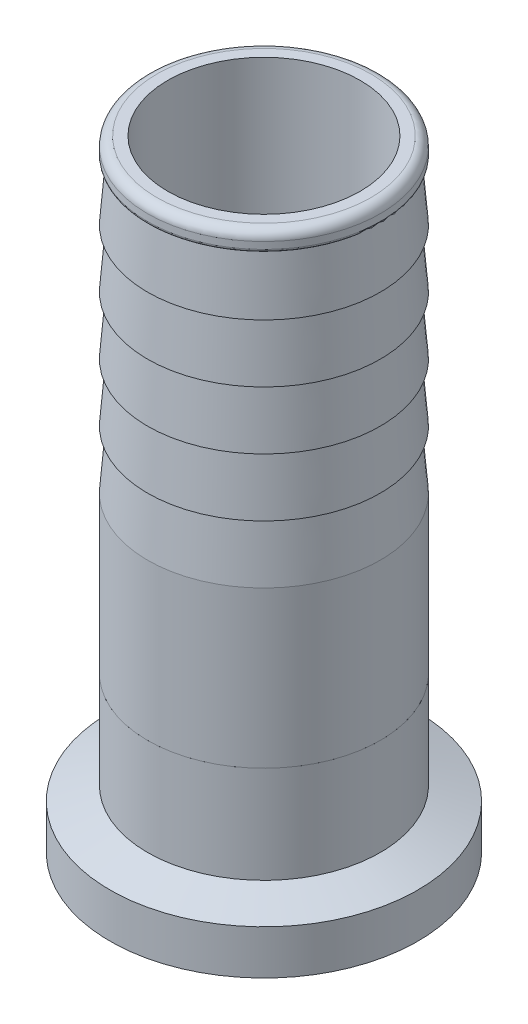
ISO-10303-21;
HEADER;
FILE_DESCRIPTION(('STEP AP214'),'2;1');
FILE_NAME('part.step','',(''),(''),'','','');
FILE_SCHEMA(('AUTOMOTIVE_DESIGN { 1 0 10303 214 1 1 1 1 }'));
ENDSEC;
DATA;
#1=APPLICATION_CONTEXT('core data for automotive mechanical design processes');
#2=APPLICATION_PROTOCOL_DEFINITION('international standard','automotive_design',2000,#1);
#3=PRODUCT_CONTEXT('',#1,'mechanical');
#4=PRODUCT('Part','Part','',(#3));
#5=PRODUCT_RELATED_PRODUCT_CATEGORY('part','',(#4));
#6=PRODUCT_DEFINITION_FORMATION('','',#4);
#7=PRODUCT_DEFINITION_CONTEXT('part definition',#1,'design');
#8=PRODUCT_DEFINITION('design','',#6,#7);
#9=PRODUCT_DEFINITION_SHAPE('','',#8);
#10=(LENGTH_UNIT() NAMED_UNIT(*) SI_UNIT(.MILLI.,.METRE.));
#11=(NAMED_UNIT(*) PLANE_ANGLE_UNIT() SI_UNIT($,.RADIAN.));
#12=(NAMED_UNIT(*) SI_UNIT($,.STERADIAN.) SOLID_ANGLE_UNIT());
#13=UNCERTAINTY_MEASURE_WITH_UNIT(LENGTH_MEASURE(1.E-05),#10,'distance_accuracy_value','');
#14=(GEOMETRIC_REPRESENTATION_CONTEXT(3) GLOBAL_UNCERTAINTY_ASSIGNED_CONTEXT((#13)) GLOBAL_UNIT_ASSIGNED_CONTEXT((#10,
#11,#12)) REPRESENTATION_CONTEXT('',''));
#15=CARTESIAN_POINT('',(0.,0.,0.));
#16=DIRECTION('',(0.,0.,1.));
#17=DIRECTION('',(1.,0.,0.));
#18=AXIS2_PLACEMENT_3D('',#15,#16,#17);
#19=CARTESIAN_POINT('',(21.4887181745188,19.9888650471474,23.0312651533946));
#20=DIRECTION('',(0.,-1.,0.));
#21=DIRECTION('',(0.114692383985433,0.,-0.993401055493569));
#22=AXIS2_PLACEMENT_3D('',#19,#20,#21);
#23=PLANE('',#22);
#24=CARTESIAN_POINT('',(12.026573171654,19.9888650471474,21.9388202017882));
#25=DIRECTION('',(0.,-1.,0.));
#26=DIRECTION('',(0.114692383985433,0.,-0.993401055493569));
#27=AXIS2_PLACEMENT_3D('',#24,#25,#26);
#28=CIRCLE('',#27,7.874);
#29=CARTESIAN_POINT('',(12.9296610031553,19.9888650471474,14.1167802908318));
#30=VERTEX_POINT('',#29);
#31=EDGE_CURVE('P0_E67',#30,#30,#28,.T.);
#32=ORIENTED_EDGE('',*,*,#31,.F.);
#33=EDGE_LOOP('',(#32));
#34=FACE_BOUND('',#33,.T.);
#35=CARTESIAN_POINT('',(12.026573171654,19.9888650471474,21.9388202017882));
#36=DIRECTION('',(0.,-1.,0.));
#37=DIRECTION('',(0.114692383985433,0.,-0.993401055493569));
#38=AXIS2_PLACEMENT_3D('',#35,#36,#37);
#39=CIRCLE('',#38,9.52499994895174);
#40=CARTESIAN_POINT('',(13.1190181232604,19.9888650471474,12.4766751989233));
#41=VERTEX_POINT('',#40);
#42=EDGE_CURVE('P0_E9',#41,#41,#39,.T.);
#43=ORIENTED_EDGE('',*,*,#42,.T.);
#44=EDGE_LOOP('',(#43));
#45=FACE_BOUND('',#44,.T.);
#46=ADVANCED_FACE('P0_F14',(#34,#45),#23,.T.);
#47=CARTESIAN_POINT('',(12.026573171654,19.9888650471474,21.9388202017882));
#48=DIRECTION('',(0.,-1.,0.));
#49=DIRECTION('',(0.114692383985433,0.,-0.993401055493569));
#50=AXIS2_PLACEMENT_3D('',#47,#48,#49);
#51=CYLINDRICAL_SURFACE('',#50,9.52499994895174);
#52=CARTESIAN_POINT('',(12.026573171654,32.7650650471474,21.9388202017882));
#53=DIRECTION('',(0.,-1.,0.));
#54=DIRECTION('',(0.114692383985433,0.,-0.993401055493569));
#55=AXIS2_PLACEMENT_3D('',#52,#53,#54);
#56=CIRCLE('',#55,9.52499994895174);
#57=CARTESIAN_POINT('',(13.1190181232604,32.7650650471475,12.4766751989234));
#58=VERTEX_POINT('',#57);
#59=EDGE_CURVE('P0_E20',#58,#58,#56,.T.);
#60=ORIENTED_EDGE('',*,*,#59,.T.);
#61=EDGE_LOOP('',(#60));
#62=FACE_BOUND('',#61,.T.);
#63=ORIENTED_EDGE('',*,*,#42,.F.);
#64=EDGE_LOOP('',(#63));
#65=FACE_BOUND('',#64,.T.);
#66=ADVANCED_FACE('P0_F83',(#62,#65),#51,.T.);
#67=CARTESIAN_POINT('',(12.026573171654,32.7650650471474,21.9388202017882));
#68=DIRECTION('',(0.,-1.,0.));
#69=DIRECTION('',(0.114692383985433,0.,-0.993401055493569));
#70=AXIS2_PLACEMENT_3D('',#67,#68,#69);
#71=CONICAL_SURFACE('',#70,9.52499994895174,0.0800425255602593);
#72=CARTESIAN_POINT('',(12.026573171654,37.5148650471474,21.9388202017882));
#73=DIRECTION('',(0.,-1.,0.));
#74=DIRECTION('',(0.114692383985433,0.,-0.993401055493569));
#75=AXIS2_PLACEMENT_3D('',#72,#73,#74);
#76=CIRCLE('',#75,9.14399994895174);
#77=CARTESIAN_POINT('',(13.0753203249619,37.5148650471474,12.8551610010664));
#78=VERTEX_POINT('',#77);
#79=EDGE_CURVE('P0_E24',#78,#78,#76,.T.);
#80=ORIENTED_EDGE('',*,*,#79,.T.);
#81=EDGE_LOOP('',(#80));
#82=FACE_BOUND('',#81,.T.);
#83=ORIENTED_EDGE('',*,*,#59,.F.);
#84=EDGE_LOOP('',(#83));
#85=FACE_BOUND('',#84,.T.);
#86=ADVANCED_FACE('P0_F88',(#82,#85),#71,.T.);
#87=CARTESIAN_POINT('',(21.4887181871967,37.5148650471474,23.0312651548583));
#88=DIRECTION('',(0.,-1.,0.));
#89=DIRECTION('',(0.114692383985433,0.,-0.993401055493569));
#90=AXIS2_PLACEMENT_3D('',#87,#88,#89);
#91=PLANE('',#90);
#92=CARTESIAN_POINT('',(12.026573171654,37.5148650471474,21.9388202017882));
#93=DIRECTION('',(0.,-1.,0.));
#94=DIRECTION('',(0.114692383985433,0.,-0.993401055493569));
#95=AXIS2_PLACEMENT_3D('',#92,#93,#94);
#96=CIRCLE('',#95,9.5249999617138);
#97=CARTESIAN_POINT('',(13.1190181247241,37.5148650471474,12.4766751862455));
#98=VERTEX_POINT('',#97);
#99=EDGE_CURVE('P0_E28',#98,#98,#96,.T.);
#100=ORIENTED_EDGE('',*,*,#99,.T.);
#101=EDGE_LOOP('',(#100));
#102=FACE_BOUND('',#101,.T.);
#103=ORIENTED_EDGE('',*,*,#79,.F.);
#104=EDGE_LOOP('',(#103));
#105=FACE_BOUND('',#104,.T.);
#106=ADVANCED_FACE('P0_F92',(#102,#105),#91,.T.);
#107=CARTESIAN_POINT('',(12.026573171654,37.5148650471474,21.9388202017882));
#108=DIRECTION('',(0.,-1.,0.));
#109=DIRECTION('',(0.114692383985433,0.,-0.993401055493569));
#110=AXIS2_PLACEMENT_3D('',#107,#108,#109);
#111=CONICAL_SURFACE('',#110,9.5249999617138,0.0800425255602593);
#112=CARTESIAN_POINT('',(12.026573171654,42.2646650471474,21.9388202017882));
#113=DIRECTION('',(0.,-1.,0.));
#114=DIRECTION('',(0.114692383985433,0.,-0.993401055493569));
#115=AXIS2_PLACEMENT_3D('',#112,#113,#114);
#116=CIRCLE('',#115,9.1439999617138);
#117=CARTESIAN_POINT('',(13.0753203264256,42.2646650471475,12.8551609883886));
#118=VERTEX_POINT('',#117);
#119=EDGE_CURVE('P0_E33',#118,#118,#116,.T.);
#120=ORIENTED_EDGE('',*,*,#119,.T.);
#121=EDGE_LOOP('',(#120));
#122=FACE_BOUND('',#121,.T.);
#123=ORIENTED_EDGE('',*,*,#99,.F.);
#124=EDGE_LOOP('',(#123));
#125=FACE_BOUND('',#124,.T.);
#126=ADVANCED_FACE('P0_F99',(#122,#125),#111,.T.);
#127=CARTESIAN_POINT('',(21.4887181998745,42.2646650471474,23.031265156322));
#128=DIRECTION('',(0.,-1.,0.));
#129=DIRECTION('',(0.114692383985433,0.,-0.993401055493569));
#130=AXIS2_PLACEMENT_3D('',#127,#128,#129);
#131=PLANE('',#130);
#132=CARTESIAN_POINT('',(12.026573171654,42.2646650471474,21.9388202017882));
#133=DIRECTION('',(0.,-1.,0.));
#134=DIRECTION('',(0.114692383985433,0.,-0.993401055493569));
#135=AXIS2_PLACEMENT_3D('',#132,#133,#134);
#136=CIRCLE('',#135,9.52499997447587);
#137=CARTESIAN_POINT('',(13.1190181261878,42.2646650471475,12.4766751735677));
#138=VERTEX_POINT('',#137);
#139=EDGE_CURVE('P0_E36',#138,#138,#136,.T.);
#140=ORIENTED_EDGE('',*,*,#139,.T.);
#141=EDGE_LOOP('',(#140));
#142=FACE_BOUND('',#141,.T.);
#143=ORIENTED_EDGE('',*,*,#119,.F.);
#144=EDGE_LOOP('',(#143));
#145=FACE_BOUND('',#144,.T.);
#146=ADVANCED_FACE('P0_F103',(#142,#145),#131,.T.);
#147=CARTESIAN_POINT('',(12.026573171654,42.2646650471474,21.9388202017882));
#148=DIRECTION('',(0.,-1.,0.));
#149=DIRECTION('',(0.114692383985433,0.,-0.993401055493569));
#150=AXIS2_PLACEMENT_3D('',#147,#148,#149);
#151=CONICAL_SURFACE('',#150,9.52499997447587,0.0800425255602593);
#152=CARTESIAN_POINT('',(12.026573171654,47.0144650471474,21.9388202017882));
#153=DIRECTION('',(0.,-1.,0.));
#154=DIRECTION('',(0.114692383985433,0.,-0.993401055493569));
#155=AXIS2_PLACEMENT_3D('',#152,#153,#154);
#156=CIRCLE('',#155,9.14399997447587);
#157=CARTESIAN_POINT('',(13.0753203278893,47.0144650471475,12.8551609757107));
#158=VERTEX_POINT('',#157);
#159=EDGE_CURVE('P0_E39',#158,#158,#156,.T.);
#160=ORIENTED_EDGE('',*,*,#159,.T.);
#161=EDGE_LOOP('',(#160));
#162=FACE_BOUND('',#161,.T.);
#163=ORIENTED_EDGE('',*,*,#139,.F.);
#164=EDGE_LOOP('',(#163));
#165=FACE_BOUND('',#164,.T.);
#166=ADVANCED_FACE('P0_F107',(#162,#165),#151,.T.);
#167=CARTESIAN_POINT('',(21.4887182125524,47.0144650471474,23.0312651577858));
#168=DIRECTION('',(0.,-1.,0.));
#169=DIRECTION('',(0.114692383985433,0.,-0.993401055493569));
#170=AXIS2_PLACEMENT_3D('',#167,#168,#169);
#171=PLANE('',#170);
#172=CARTESIAN_POINT('',(12.026573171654,47.0144650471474,21.9388202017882));
#173=DIRECTION('',(0.,-1.,0.));
#174=DIRECTION('',(0.114692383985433,0.,-0.993401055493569));
#175=AXIS2_PLACEMENT_3D('',#172,#173,#174);
#176=CIRCLE('',#175,9.52499998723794);
#177=CARTESIAN_POINT('',(13.1190181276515,47.0144650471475,12.4766751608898));
#178=VERTEX_POINT('',#177);
#179=EDGE_CURVE('P0_E42',#178,#178,#176,.T.);
#180=ORIENTED_EDGE('',*,*,#179,.T.);
#181=EDGE_LOOP('',(#180));
#182=FACE_BOUND('',#181,.T.);
#183=ORIENTED_EDGE('',*,*,#159,.F.);
#184=EDGE_LOOP('',(#183));
#185=FACE_BOUND('',#184,.T.);
#186=ADVANCED_FACE('P0_F111',(#182,#185),#171,.T.);
#187=CARTESIAN_POINT('',(12.026573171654,47.0144650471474,21.9388202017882));
#188=DIRECTION('',(0.,-1.,0.));
#189=DIRECTION('',(0.114692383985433,0.,-0.993401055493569));
#190=AXIS2_PLACEMENT_3D('',#187,#188,#189);
#191=CONICAL_SURFACE('',#190,9.52499998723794,0.0800425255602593);
#192=CARTESIAN_POINT('',(12.026573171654,51.7642650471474,21.9388202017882));
#193=DIRECTION('',(0.,-1.,0.));
#194=DIRECTION('',(0.114692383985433,0.,-0.993401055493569));
#195=AXIS2_PLACEMENT_3D('',#192,#193,#194);
#196=CIRCLE('',#195,9.14399998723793);
#197=CARTESIAN_POINT('',(13.075320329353,51.7642650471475,12.8551609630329));
#198=VERTEX_POINT('',#197);
#199=EDGE_CURVE('P0_E45',#198,#198,#196,.T.);
#200=ORIENTED_EDGE('',*,*,#199,.T.);
#201=EDGE_LOOP('',(#200));
#202=FACE_BOUND('',#201,.T.);
#203=ORIENTED_EDGE('',*,*,#179,.F.);
#204=EDGE_LOOP('',(#203));
#205=FACE_BOUND('',#204,.T.);
#206=ADVANCED_FACE('P0_F115',(#202,#205),#191,.T.);
#207=CARTESIAN_POINT('',(21.4887182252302,51.7642650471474,23.0312651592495));
#208=DIRECTION('',(0.,-1.,0.));
#209=DIRECTION('',(0.114692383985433,0.,-0.993401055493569));
#210=AXIS2_PLACEMENT_3D('',#207,#208,#209);
#211=PLANE('',#210);
#212=CARTESIAN_POINT('',(12.026573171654,51.7642650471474,21.9388202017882));
#213=DIRECTION('',(0.,-1.,0.));
#214=DIRECTION('',(0.114692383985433,0.,-0.993401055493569));
#215=AXIS2_PLACEMENT_3D('',#212,#213,#214);
#216=CIRCLE('',#215,9.525);
#217=CARTESIAN_POINT('',(13.1190181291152,51.7642650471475,12.476675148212));
#218=VERTEX_POINT('',#217);
#219=EDGE_CURVE('P0_E48',#218,#218,#216,.T.);
#220=ORIENTED_EDGE('',*,*,#219,.T.);
#221=EDGE_LOOP('',(#220));
#222=FACE_BOUND('',#221,.T.);
#223=ORIENTED_EDGE('',*,*,#199,.F.);
#224=EDGE_LOOP('',(#223));
#225=FACE_BOUND('',#224,.T.);
#226=ADVANCED_FACE('P0_F119',(#222,#225),#211,.T.);
#227=CARTESIAN_POINT('',(12.026573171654,51.7642650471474,21.9388202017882));
#228=DIRECTION('',(0.,-1.,0.));
#229=DIRECTION('',(0.114692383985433,0.,-0.993401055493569));
#230=AXIS2_PLACEMENT_3D('',#227,#228,#229);
#231=CONICAL_SURFACE('',#230,9.525,0.0800425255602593);
#232=CARTESIAN_POINT('',(12.026573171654,56.5140650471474,21.9388202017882));
#233=DIRECTION('',(0.,-1.,0.));
#234=DIRECTION('',(0.114692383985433,0.,-0.993401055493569));
#235=AXIS2_PLACEMENT_3D('',#232,#233,#234);
#236=CIRCLE('',#235,9.144);
#237=CARTESIAN_POINT('',(13.0753203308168,56.5140650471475,12.855160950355));
#238=VERTEX_POINT('',#237);
#239=EDGE_CURVE('P0_E51',#238,#238,#236,.T.);
#240=ORIENTED_EDGE('',*,*,#239,.T.);
#241=EDGE_LOOP('',(#240));
#242=FACE_BOUND('',#241,.T.);
#243=ORIENTED_EDGE('',*,*,#219,.F.);
#244=EDGE_LOOP('',(#243));
#245=FACE_BOUND('',#244,.T.);
#246=ADVANCED_FACE('P0_F123',(#242,#245),#231,.T.);
#247=CARTESIAN_POINT('',(21.2363943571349,56.5140650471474,23.0021332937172));
#248=DIRECTION('',(0.,-1.,0.));
#249=DIRECTION('',(0.114692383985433,0.,-0.993401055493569));
#250=AXIS2_PLACEMENT_3D('',#247,#248,#249);
#251=PLANE('',#250);
#252=CARTESIAN_POINT('',(12.026573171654,56.5140650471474,21.9388202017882));
#253=DIRECTION('',(0.,-1.,0.));
#254=DIRECTION('',(0.114692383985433,0.,-0.993401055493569));
#255=AXIS2_PLACEMENT_3D('',#252,#253,#254);
#256=CIRCLE('',#255,9.27100000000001);
#257=CARTESIAN_POINT('',(13.0898862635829,56.5140650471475,12.7289990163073));
#258=VERTEX_POINT('',#257);
#259=EDGE_CURVE('P0_E54',#258,#258,#256,.T.);
#260=ORIENTED_EDGE('',*,*,#259,.T.);
#261=EDGE_LOOP('',(#260));
#262=FACE_BOUND('',#261,.T.);
#263=ORIENTED_EDGE('',*,*,#239,.F.);
#264=EDGE_LOOP('',(#263));
#265=FACE_BOUND('',#264,.T.);
#266=ADVANCED_FACE('P0_F127',(#262,#265),#251,.T.);
#267=CARTESIAN_POINT('',(12.026573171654,56.7680650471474,21.9388202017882));
#268=DIRECTION('',(0.,-1.,0.));
#269=DIRECTION('',(0.114692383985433,0.,-0.993401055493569));
#270=AXIS2_PLACEMENT_3D('',#267,#268,#269);
#271=TOROIDAL_SURFACE('',#270,9.271,0.253999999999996);
#272=CARTESIAN_POINT('',(12.026573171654,56.7680650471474,21.9388202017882));
#273=DIRECTION('',(0.,-1.,0.));
#274=DIRECTION('',(0.114692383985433,0.,-0.993401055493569));
#275=AXIS2_PLACEMENT_3D('',#272,#273,#274);
#276=CIRCLE('',#275,9.52499999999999);
#277=CARTESIAN_POINT('',(13.1190181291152,56.7680650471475,12.476675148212));
#278=VERTEX_POINT('',#277);
#279=EDGE_CURVE('P0_E57',#278,#278,#276,.T.);
#280=ORIENTED_EDGE('',*,*,#279,.T.);
#281=EDGE_LOOP('',(#280));
#282=FACE_BOUND('',#281,.T.);
#283=ORIENTED_EDGE('',*,*,#259,.F.);
#284=EDGE_LOOP('',(#283));
#285=FACE_BOUND('',#284,.T.);
#286=ADVANCED_FACE('P0_F131',(#282,#285),#271,.T.);
#287=CARTESIAN_POINT('',(12.026573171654,19.9888650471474,21.9388202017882));
#288=DIRECTION('',(0.,-1.,0.));
#289=DIRECTION('',(0.114692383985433,0.,-0.993401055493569));
#290=AXIS2_PLACEMENT_3D('',#287,#288,#289);
#291=CYLINDRICAL_SURFACE('',#290,9.525);
#292=CARTESIAN_POINT('',(12.026573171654,57.3268650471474,21.9388202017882));
#293=DIRECTION('',(0.,-1.,0.));
#294=DIRECTION('',(0.114692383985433,0.,-0.993401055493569));
#295=AXIS2_PLACEMENT_3D('',#292,#293,#294);
#296=CIRCLE('',#295,9.525);
#297=CARTESIAN_POINT('',(13.1190181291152,57.3268650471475,12.476675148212));
#298=VERTEX_POINT('',#297);
#299=EDGE_CURVE('P0_E60',#298,#298,#296,.T.);
#300=ORIENTED_EDGE('',*,*,#299,.T.);
#301=EDGE_LOOP('',(#300));
#302=FACE_BOUND('',#301,.T.);
#303=ORIENTED_EDGE('',*,*,#279,.F.);
#304=EDGE_LOOP('',(#303));
#305=FACE_BOUND('',#304,.T.);
#306=ADVANCED_FACE('P0_F135',(#302,#305),#291,.T.);
#307=CARTESIAN_POINT('',(12.026573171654,57.3268650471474,21.9388202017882));
#308=DIRECTION('',(0.,-1.,0.));
#309=DIRECTION('',(0.114692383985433,0.,-0.993401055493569));
#310=AXIS2_PLACEMENT_3D('',#307,#308,#309);
#311=TOROIDAL_SURFACE('',#310,8.763,0.762000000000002);
#312=CARTESIAN_POINT('',(12.026573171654,58.0888650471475,21.9388202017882));
#313=DIRECTION('',(0.,-1.,0.));
#314=DIRECTION('',(0.114692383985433,0.,-0.993401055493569));
#315=AXIS2_PLACEMENT_3D('',#312,#313,#314);
#316=CIRCLE('',#315,8.763);
#317=CARTESIAN_POINT('',(13.0316225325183,58.0888650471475,13.2336467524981));
#318=VERTEX_POINT('',#317);
#319=EDGE_CURVE('P0_E63',#318,#318,#316,.T.);
#320=ORIENTED_EDGE('',*,*,#319,.T.);
#321=EDGE_LOOP('',(#320));
#322=FACE_BOUND('',#321,.T.);
#323=ORIENTED_EDGE('',*,*,#299,.F.);
#324=EDGE_LOOP('',(#323));
#325=FACE_BOUND('',#324,.T.);
#326=ADVANCED_FACE('P0_F139',(#322,#325),#311,.T.);
#327=CARTESIAN_POINT('',(12.026573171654,58.0888650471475,21.9388202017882));
#328=DIRECTION('',(0.,1.,0.));
#329=DIRECTION('',(-0.114692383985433,0.,0.993401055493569));
#330=AXIS2_PLACEMENT_3D('',#327,#328,#329);
#331=PLANE('',#330);
#332=CARTESIAN_POINT('',(12.026573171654,58.0888650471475,21.9388202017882));
#333=DIRECTION('',(0.,-1.,0.));
#334=DIRECTION('',(0.114692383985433,0.,-0.993401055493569));
#335=AXIS2_PLACEMENT_3D('',#332,#333,#334);
#336=CIRCLE('',#335,7.874);
#337=CARTESIAN_POINT('',(12.9296610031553,58.0888650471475,14.1167802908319));
#338=VERTEX_POINT('',#337);
#339=EDGE_CURVE('P0_E66',#338,#338,#336,.T.);
#340=ORIENTED_EDGE('',*,*,#339,.T.);
#341=EDGE_LOOP('',(#340));
#342=FACE_BOUND('',#341,.T.);
#343=ORIENTED_EDGE('',*,*,#319,.F.);
#344=EDGE_LOOP('',(#343));
#345=FACE_BOUND('',#344,.T.);
#346=ADVANCED_FACE('P0_F73',(#342,#345),#331,.T.);
#347=CARTESIAN_POINT('',(12.026573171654,58.0888650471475,21.9388202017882));
#348=DIRECTION('',(0.,-1.,0.));
#349=DIRECTION('',(0.114692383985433,0.,-0.993401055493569));
#350=AXIS2_PLACEMENT_3D('',#347,#348,#349);
#351=CYLINDRICAL_SURFACE('',#350,7.874);
#352=ORIENTED_EDGE('',*,*,#339,.F.);
#353=EDGE_LOOP('',(#352));
#354=FACE_BOUND('',#353,.T.);
#355=ORIENTED_EDGE('',*,*,#31,.T.);
#356=EDGE_LOOP('',(#355));
#357=FACE_BOUND('',#356,.T.);
#358=ADVANCED_FACE('P0_F76',(#354,#357),#351,.F.);
#359=CLOSED_SHELL('',(#46,#66,#86,#106,#126,#146,#166,#186,#206,#226,#246,#266,#286,#306,#326,
#346,#358));
#360=MANIFOLD_SOLID_BREP('P0_B1',#359);
#361=CARTESIAN_POINT('',(12.0265731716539,7.28886504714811,21.9388202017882));
#362=DIRECTION('',(0.,-1.,0.));
#363=DIRECTION('',(0.,0.,-1.00000000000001));
#364=AXIS2_PLACEMENT_3D('',#361,#362,#363);
#365=CYLINDRICAL_SURFACE('',#364,10.922);
#366=CARTESIAN_POINT('',(12.0265731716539,8.60966504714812,21.9388202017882));
#367=DIRECTION('',(0.,-1.,0.));
#368=DIRECTION('',(0.,0.,-1.00000000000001));
#369=AXIS2_PLACEMENT_3D('',#366,#367,#368);
#370=CIRCLE('',#369,10.922);
#371=CARTESIAN_POINT('',(12.0265731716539,8.60966504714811,11.0168202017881));
#372=VERTEX_POINT('',#371);
#373=EDGE_CURVE('P1_E10',#372,#372,#370,.T.);
#374=ORIENTED_EDGE('',*,*,#373,.F.);
#375=EDGE_LOOP('',(#374));
#376=FACE_BOUND('',#375,.T.);
#377=CARTESIAN_POINT('',(12.0265731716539,7.28886504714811,21.9388202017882));
#378=DIRECTION('',(0.,-1.,0.));
#379=DIRECTION('',(0.,0.,-1.00000000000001));
#380=AXIS2_PLACEMENT_3D('',#377,#378,#379);
#381=CIRCLE('',#380,10.922);
#382=CARTESIAN_POINT('',(12.0265731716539,7.2888650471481,11.0168202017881));
#383=VERTEX_POINT('',#382);
#384=EDGE_CURVE('P1_E49',#383,#383,#381,.T.);
#385=ORIENTED_EDGE('',*,*,#384,.T.);
#386=EDGE_LOOP('',(#385));
#387=FACE_BOUND('',#386,.T.);
#388=ADVANCED_FACE('P1_F15',(#376,#387),#365,.F.);
#389=CARTESIAN_POINT('',(12.0265731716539,8.60966504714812,21.9388202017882));
#390=DIRECTION('',(0.,-1.,0.));
#391=DIRECTION('',(0.,0.,-1.00000000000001));
#392=AXIS2_PLACEMENT_3D('',#389,#390,#391);
#393=TOROIDAL_SURFACE('',#392,10.1473,0.7747);
#394=CARTESIAN_POINT('',(12.0265731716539,9.14186396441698,21.9388202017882));
#395=DIRECTION('',(0.,-1.,0.));
#396=DIRECTION('',(0.,0.,-1.00000000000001));
#397=AXIS2_PLACEMENT_3D('',#394,#395,#396);
#398=CIRCLE('',#397,9.58433960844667);
#399=CARTESIAN_POINT('',(12.0265731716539,9.14186396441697,12.3544805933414));
#400=VERTEX_POINT('',#399);
#401=EDGE_CURVE('P1_E21',#400,#400,#398,.T.);
#402=ORIENTED_EDGE('',*,*,#401,.F.);
#403=EDGE_LOOP('',(#402));
#404=FACE_BOUND('',#403,.T.);
#405=ORIENTED_EDGE('',*,*,#373,.T.);
#406=EDGE_LOOP('',(#405));
#407=FACE_BOUND('',#406,.T.);
#408=ADVANCED_FACE('P1_F98',(#404,#407),#393,.F.);
#409=CARTESIAN_POINT('',(12.0265731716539,9.14186396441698,21.9388202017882));
#410=DIRECTION('',(0.,1.,0.));
#411=DIRECTION('',(0.,0.,1.00000000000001));
#412=AXIS2_PLACEMENT_3D('',#409,#410,#411);
#413=CONICAL_SURFACE('',#412,9.58433960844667,0.794623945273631);
#414=CARTESIAN_POINT('',(12.0265731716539,8.17786504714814,21.9388202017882));
#415=DIRECTION('',(0.,-1.,0.));
#416=DIRECTION('',(0.,0.,-1.00000000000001));
#417=AXIS2_PLACEMENT_3D('',#414,#415,#416);
#418=CIRCLE('',#417,8.60238725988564);
#419=CARTESIAN_POINT('',(12.0265731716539,8.17786504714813,13.3364329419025));
#420=VERTEX_POINT('',#419);
#421=EDGE_CURVE('P1_E25',#420,#420,#418,.T.);
#422=ORIENTED_EDGE('',*,*,#421,.F.);
#423=EDGE_LOOP('',(#422));
#424=FACE_BOUND('',#423,.T.);
#425=ORIENTED_EDGE('',*,*,#401,.T.);
#426=EDGE_LOOP('',(#425));
#427=FACE_BOUND('',#426,.T.);
#428=ADVANCED_FACE('P1_F93',(#424,#427),#413,.T.);
#429=CARTESIAN_POINT('',(3.42418591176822,8.17786504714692,21.9388202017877));
#430=DIRECTION('',(0.,1.,0.));
#431=DIRECTION('',(0.,0.,1.00000000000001));
#432=AXIS2_PLACEMENT_3D('',#429,#430,#431);
#433=PLANE('',#432);
#434=CARTESIAN_POINT('',(12.0265731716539,8.17786504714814,21.9388202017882));
#435=DIRECTION('',(0.,-1.,0.));
#436=DIRECTION('',(0.,0.,-1.00000000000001));
#437=AXIS2_PLACEMENT_3D('',#434,#435,#436);
#438=CIRCLE('',#437,7.874);
#439=CARTESIAN_POINT('',(12.0265731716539,8.17786504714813,14.0648202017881));
#440=VERTEX_POINT('',#439);
#441=EDGE_CURVE('P1_E29',#440,#440,#438,.T.);
#442=ORIENTED_EDGE('',*,*,#441,.F.);
#443=EDGE_LOOP('',(#442));
#444=FACE_BOUND('',#443,.T.);
#445=ORIENTED_EDGE('',*,*,#421,.T.);
#446=EDGE_LOOP('',(#445));
#447=FACE_BOUND('',#446,.T.);
#448=ADVANCED_FACE('P1_F87',(#444,#447),#433,.F.);
#449=CARTESIAN_POINT('',(12.0265731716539,7.28886504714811,21.9388202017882));
#450=DIRECTION('',(0.,-1.,0.));
#451=DIRECTION('',(0.,0.,-1.00000000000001));
#452=AXIS2_PLACEMENT_3D('',#449,#450,#451);
#453=CYLINDRICAL_SURFACE('',#452,7.874);
#454=CARTESIAN_POINT('',(12.026573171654,19.9888650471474,21.9388202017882));
#455=DIRECTION('',(0.,-1.,0.));
#456=DIRECTION('',(0.,0.,-1.00000000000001));
#457=AXIS2_PLACEMENT_3D('',#454,#455,#456);
#458=CIRCLE('',#457,7.874);
#459=CARTESIAN_POINT('',(12.026573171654,19.9888650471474,14.0648202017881));
#460=VERTEX_POINT('',#459);
#461=EDGE_CURVE('P1_E34',#460,#460,#458,.T.);
#462=ORIENTED_EDGE('',*,*,#461,.F.);
#463=EDGE_LOOP('',(#462));
#464=FACE_BOUND('',#463,.T.);
#465=ORIENTED_EDGE('',*,*,#441,.T.);
#466=EDGE_LOOP('',(#465));
#467=FACE_BOUND('',#466,.T.);
#468=ADVANCED_FACE('P1_F81',(#464,#467),#453,.F.);
#469=CARTESIAN_POINT('',(4.15257317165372,19.9888650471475,21.9388202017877));
#470=DIRECTION('',(0.,-1.,0.));
#471=DIRECTION('',(0.,0.,-1.00000000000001));
#472=AXIS2_PLACEMENT_3D('',#469,#470,#471);
#473=PLANE('',#472);
#474=CARTESIAN_POINT('',(12.026573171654,19.9888650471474,21.9388202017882));
#475=DIRECTION('',(0.,-1.,0.));
#476=DIRECTION('',(0.,0.,-1.00000000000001));
#477=AXIS2_PLACEMENT_3D('',#474,#475,#476);
#478=CIRCLE('',#477,9.525);
#479=CARTESIAN_POINT('',(12.026573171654,19.9888650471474,12.4138202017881));
#480=VERTEX_POINT('',#479);
#481=EDGE_CURVE('P1_E37',#480,#480,#478,.T.);
#482=ORIENTED_EDGE('',*,*,#481,.F.);
#483=EDGE_LOOP('',(#482));
#484=FACE_BOUND('',#483,.T.);
#485=ORIENTED_EDGE('',*,*,#461,.T.);
#486=EDGE_LOOP('',(#485));
#487=FACE_BOUND('',#486,.T.);
#488=ADVANCED_FACE('P1_F75',(#484,#487),#473,.F.);
#489=CARTESIAN_POINT('',(12.0265731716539,7.28886504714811,21.9388202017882));
#490=DIRECTION('',(0.,-1.,0.));
#491=DIRECTION('',(0.,0.,-1.00000000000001));
#492=AXIS2_PLACEMENT_3D('',#489,#490,#491);
#493=CYLINDRICAL_SURFACE('',#492,9.525);
#494=CARTESIAN_POINT('',(12.0265731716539,12.0396911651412,21.9388202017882));
#495=DIRECTION('',(0.,-1.,0.));
#496=DIRECTION('',(0.,0.,-1.00000000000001));
#497=AXIS2_PLACEMENT_3D('',#494,#495,#496);
#498=CIRCLE('',#497,9.525);
#499=CARTESIAN_POINT('',(12.0265731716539,12.0396911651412,12.4138202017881));
#500=VERTEX_POINT('',#499);
#501=EDGE_CURVE('P1_E40',#500,#500,#498,.T.);
#502=ORIENTED_EDGE('',*,*,#501,.F.);
#503=EDGE_LOOP('',(#502));
#504=FACE_BOUND('',#503,.T.);
#505=ORIENTED_EDGE('',*,*,#481,.T.);
#506=EDGE_LOOP('',(#505));
#507=FACE_BOUND('',#506,.T.);
#508=ADVANCED_FACE('P1_F69',(#504,#507),#493,.T.);
#509=CARTESIAN_POINT('',(12.0265731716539,12.0396911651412,21.9388202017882));
#510=DIRECTION('',(0.,-1.,0.));
#511=DIRECTION('',(0.,0.,-1.00000000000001));
#512=AXIS2_PLACEMENT_3D('',#509,#510,#511);
#513=CONICAL_SURFACE('',#512,9.525,1.22173047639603);
#514=CARTESIAN_POINT('',(12.0265731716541,10.9210650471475,21.9388202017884));
#515=DIRECTION('',(0.,-1.,0.));
#516=DIRECTION('',(0.,0.,-1.00000000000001));
#517=AXIS2_PLACEMENT_3D('',#514,#515,#516);
#518=CIRCLE('',#517,12.5984);
#519=CARTESIAN_POINT('',(12.0265731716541,10.9210650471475,9.3404202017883));
#520=VERTEX_POINT('',#519);
#521=EDGE_CURVE('P1_E43',#520,#520,#518,.T.);
#522=ORIENTED_EDGE('',*,*,#521,.F.);
#523=EDGE_LOOP('',(#522));
#524=FACE_BOUND('',#523,.T.);
#525=ORIENTED_EDGE('',*,*,#501,.T.);
#526=EDGE_LOOP('',(#525));
#527=FACE_BOUND('',#526,.T.);
#528=ADVANCED_FACE('P1_F63',(#524,#527),#513,.T.);
#529=CARTESIAN_POINT('',(12.0265731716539,7.28886504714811,21.9388202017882));
#530=DIRECTION('',(0.,-1.,0.));
#531=DIRECTION('',(0.,0.,-1.00000000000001));
#532=AXIS2_PLACEMENT_3D('',#529,#530,#531);
#533=CYLINDRICAL_SURFACE('',#532,12.5984);
#534=CARTESIAN_POINT('',(12.0265731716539,7.28886504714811,21.9388202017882));
#535=DIRECTION('',(0.,-1.,0.));
#536=DIRECTION('',(0.,0.,-1.00000000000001));
#537=AXIS2_PLACEMENT_3D('',#534,#535,#536);
#538=CIRCLE('',#537,12.5984);
#539=CARTESIAN_POINT('',(12.0265731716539,7.2888650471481,9.34042020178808));
#540=VERTEX_POINT('',#539);
#541=EDGE_CURVE('P1_E46',#540,#540,#538,.T.);
#542=ORIENTED_EDGE('',*,*,#541,.F.);
#543=EDGE_LOOP('',(#542));
#544=FACE_BOUND('',#543,.T.);
#545=ORIENTED_EDGE('',*,*,#521,.T.);
#546=EDGE_LOOP('',(#545));
#547=FACE_BOUND('',#546,.T.);
#548=ADVANCED_FACE('P1_F57',(#544,#547),#533,.T.);
#549=CARTESIAN_POINT('',(-0.571826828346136,7.28886504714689,21.938820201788));
#550=DIRECTION('',(0.,1.,0.));
#551=DIRECTION('',(0.,0.,1.00000000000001));
#552=AXIS2_PLACEMENT_3D('',#549,#550,#551);
#553=PLANE('',#552);
#554=ORIENTED_EDGE('',*,*,#384,.F.);
#555=EDGE_LOOP('',(#554));
#556=FACE_BOUND('',#555,.T.);
#557=ORIENTED_EDGE('',*,*,#541,.T.);
#558=EDGE_LOOP('',(#557));
#559=FACE_BOUND('',#558,.T.);
#560=ADVANCED_FACE('P1_F54',(#556,#559),#553,.F.);
#561=CLOSED_SHELL('',(#388,#408,#428,#448,#468,#488,#508,#528,#548,#560));
#562=MANIFOLD_SOLID_BREP('P1_B1',#561);
#563=ADVANCED_BREP_SHAPE_REPRESENTATION('',(#18,#360,#562),#14);
#564=SHAPE_DEFINITION_REPRESENTATION(#9,#563);
ENDSEC;
END-ISO-10303-21;
